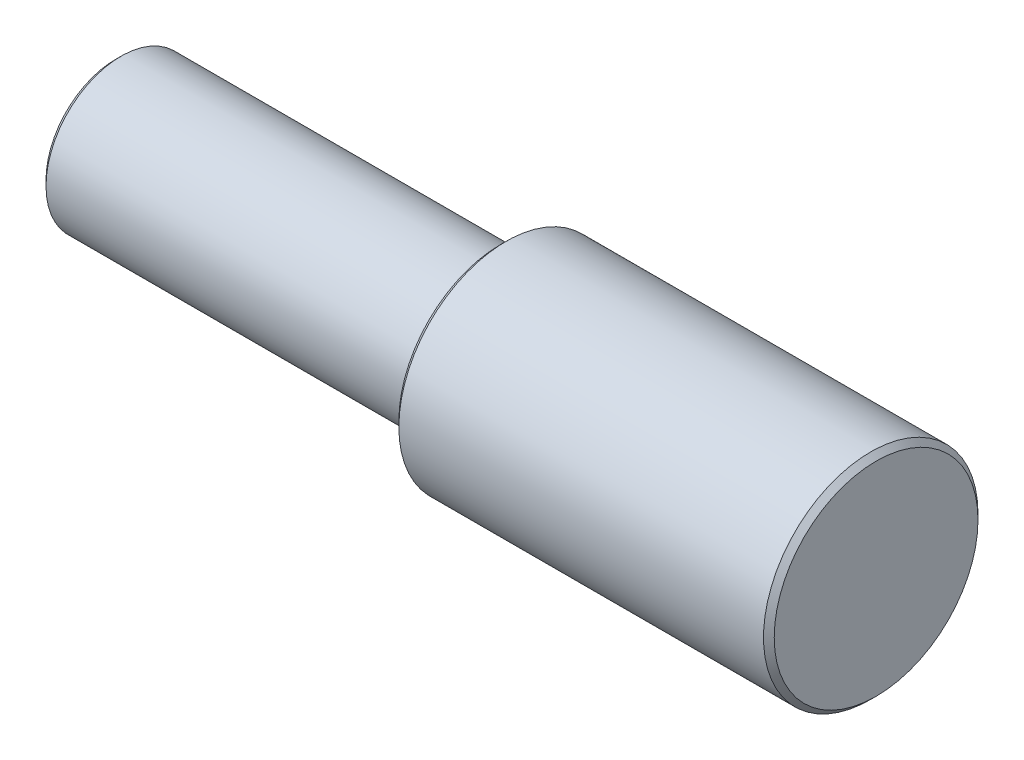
ISO-10303-21;
HEADER;
FILE_DESCRIPTION(('STEP AP214'),'2;1');
FILE_NAME('part.step','',(''),(''),'','','');
FILE_SCHEMA(('AUTOMOTIVE_DESIGN { 1 0 10303 214 1 1 1 1 }'));
ENDSEC;
DATA;
#1=APPLICATION_CONTEXT('core data for automotive mechanical design processes');
#2=APPLICATION_PROTOCOL_DEFINITION('international standard','automotive_design',2000,#1);
#3=PRODUCT_CONTEXT('',#1,'mechanical');
#4=PRODUCT('Part','Part','',(#3));
#5=PRODUCT_RELATED_PRODUCT_CATEGORY('part','',(#4));
#6=PRODUCT_DEFINITION_FORMATION('','',#4);
#7=PRODUCT_DEFINITION_CONTEXT('part definition',#1,'design');
#8=PRODUCT_DEFINITION('design','',#6,#7);
#9=PRODUCT_DEFINITION_SHAPE('','',#8);
#10=(LENGTH_UNIT() NAMED_UNIT(*) SI_UNIT(.MILLI.,.METRE.));
#11=(NAMED_UNIT(*) PLANE_ANGLE_UNIT() SI_UNIT($,.RADIAN.));
#12=(NAMED_UNIT(*) SI_UNIT($,.STERADIAN.) SOLID_ANGLE_UNIT());
#13=UNCERTAINTY_MEASURE_WITH_UNIT(LENGTH_MEASURE(1.E-05),#10,'distance_accuracy_value','');
#14=(GEOMETRIC_REPRESENTATION_CONTEXT(3) GLOBAL_UNCERTAINTY_ASSIGNED_CONTEXT((#13)) GLOBAL_UNIT_ASSIGNED_CONTEXT((#10,
#11,#12)) REPRESENTATION_CONTEXT('',''));
#15=CARTESIAN_POINT('',(0.,0.,0.));
#16=DIRECTION('',(0.,0.,1.));
#17=DIRECTION('',(1.,0.,0.));
#18=AXIS2_PLACEMENT_3D('',#15,#16,#17);
#19=CARTESIAN_POINT('',(-35.,0.,0.));
#20=DIRECTION('',(1.,0.,0.));
#21=DIRECTION('',(0.,0.,-1.));
#22=AXIS2_PLACEMENT_3D('',#19,#20,#21);
#23=CYLINDRICAL_SURFACE('',#22,10.);
#24=CARTESIAN_POINT('',(-0.500000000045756,0.,0.));
#25=DIRECTION('',(1.,0.,0.));
#26=DIRECTION('',(0.,0.,-1.));
#27=AXIS2_PLACEMENT_3D('',#24,#25,#26);
#28=CIRCLE('',#27,10.);
#29=CARTESIAN_POINT('',(-0.500000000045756,0.,-10.));
#30=VERTEX_POINT('',#29);
#31=EDGE_CURVE('E123',#30,#30,#28,.F.);
#32=ORIENTED_EDGE('',*,*,#31,.T.);
#33=EDGE_LOOP('',(#32));
#34=FACE_BOUND('',#33,.T.);
#35=CARTESIAN_POINT('',(-34.4999999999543,0.,0.));
#36=DIRECTION('',(-1.,0.,0.));
#37=DIRECTION('',(0.,0.,1.));
#38=AXIS2_PLACEMENT_3D('',#35,#36,#37);
#39=CIRCLE('',#38,10.);
#40=CARTESIAN_POINT('',(-34.4999999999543,0.,10.));
#41=VERTEX_POINT('',#40);
#42=EDGE_CURVE('E120',#41,#41,#39,.F.);
#43=ORIENTED_EDGE('',*,*,#42,.T.);
#44=EDGE_LOOP('',(#43));
#45=FACE_BOUND('',#44,.T.);
#46=ADVANCED_FACE('F35',(#34,#45),#23,.T.);
#47=CARTESIAN_POINT('',(-35.,10.,0.));
#48=DIRECTION('',(-1.,0.,0.));
#49=DIRECTION('',(0.,0.,1.));
#50=AXIS2_PLACEMENT_3D('',#47,#48,#49);
#51=PLANE('',#50);
#52=CARTESIAN_POINT('',(-35.,0.,0.));
#53=DIRECTION('',(-1.,0.,0.));
#54=DIRECTION('',(0.,0.,1.));
#55=AXIS2_PLACEMENT_3D('',#52,#53,#54);
#56=CIRCLE('',#55,9.49999999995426);
#57=CARTESIAN_POINT('',(-35.,0.,9.49999999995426));
#58=VERTEX_POINT('',#57);
#59=EDGE_CURVE('E126',#58,#58,#56,.T.);
#60=ORIENTED_EDGE('',*,*,#59,.T.);
#61=EDGE_LOOP('',(#60));
#62=FACE_BOUND('',#61,.T.);
#63=CARTESIAN_POINT('',(-35.,0.,0.));
#64=DIRECTION('',(-1.,0.,0.));
#65=DIRECTION('',(0.,0.,1.));
#66=AXIS2_PLACEMENT_3D('',#63,#64,#65);
#67=CIRCLE('',#66,6.99999999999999);
#68=CARTESIAN_POINT('',(-35.,0.,6.99999999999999));
#69=VERTEX_POINT('',#68);
#70=EDGE_CURVE('E114',#69,#69,#67,.T.);
#71=ORIENTED_EDGE('',*,*,#70,.F.);
#72=EDGE_LOOP('',(#71));
#73=FACE_BOUND('',#72,.T.);
#74=ADVANCED_FACE('F182',(#62,#73),#51,.T.);
#75=CARTESIAN_POINT('',(0.,0.,0.));
#76=DIRECTION('',(1.,0.,0.));
#77=DIRECTION('',(0.,0.,-1.));
#78=AXIS2_PLACEMENT_3D('',#75,#76,#77);
#79=PLANE('',#78);
#80=CARTESIAN_POINT('',(0.,0.,0.));
#81=DIRECTION('',(1.,0.,0.));
#82=DIRECTION('',(0.,0.,-1.));
#83=AXIS2_PLACEMENT_3D('',#80,#81,#82);
#84=CIRCLE('',#83,9.49999999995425);
#85=CARTESIAN_POINT('',(0.,0.,-9.49999999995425));
#86=VERTEX_POINT('',#85);
#87=EDGE_CURVE('E117',#86,#86,#84,.T.);
#88=ORIENTED_EDGE('',*,*,#87,.T.);
#89=EDGE_LOOP('',(#88));
#90=FACE_BOUND('',#89,.T.);
#91=ADVANCED_FACE('F178',(#90),#79,.T.);
#92=CARTESIAN_POINT('',(-70.9,0.,0.));
#93=DIRECTION('',(1.,0.,0.));
#94=DIRECTION('',(0.,0.,-1.));
#95=AXIS2_PLACEMENT_3D('',#92,#93,#94);
#96=CYLINDRICAL_SURFACE('',#95,6.99999999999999);
#97=DIRECTION('',(1.,0.,0.));
#98=VECTOR('',#97,1.);
#99=CARTESIAN_POINT('',(-70.9,-2.5,-6.538348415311));
#100=LINE('',#99,#98);
#101=CARTESIAN_POINT('',(-65.45,-2.5,-6.538348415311));
#102=VERTEX_POINT('',#101);
#103=CARTESIAN_POINT('',(-40.45,-2.5,-6.538348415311));
#104=VERTEX_POINT('',#103);
#105=EDGE_CURVE('E49',#102,#104,#100,.T.);
#106=ORIENTED_EDGE('',*,*,#105,.T.);
#107=CARTESIAN_POINT('',(-40.45,-2.5,-6.53834841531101));
#108=CARTESIAN_POINT('',(-40.3821107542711,-2.50000932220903,-6.53833653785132));
#109=CARTESIAN_POINT('',(-40.3142280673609,-2.49723485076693,-6.53940549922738));
#110=CARTESIAN_POINT('',(-40.1789960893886,-2.48619102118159,-6.54361657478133));
#111=CARTESIAN_POINT('',(-40.1116466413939,-2.47792334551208,-6.54675805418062));
#112=CARTESIAN_POINT('',(-39.9781785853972,-2.45600175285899,-6.55501217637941));
#113=CARTESIAN_POINT('',(-39.9120566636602,-2.44236559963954,-6.56011831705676));
#114=CARTESIAN_POINT('',(-39.7812981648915,-2.40985115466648,-6.57213177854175));
#115=CARTESIAN_POINT('',(-39.7166616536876,-2.39097263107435,-6.57903917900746));
#116=CARTESIAN_POINT('',(-39.5257356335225,-2.32673964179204,-6.60214934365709));
#117=CARTESIAN_POINT('',(-39.4022095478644,-2.27375112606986,-6.62075475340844));
#118=CARTESIAN_POINT('',(-39.165769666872,-2.14910757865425,-6.6622539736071));
#119=CARTESIAN_POINT('',(-39.0528636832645,-2.07743895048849,-6.68515090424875));
#120=CARTESIAN_POINT('',(-38.8357847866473,-1.91402571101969,-6.73379913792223));
#121=CARTESIAN_POINT('',(-38.7321535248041,-1.82158337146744,-6.75962864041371));
#122=CARTESIAN_POINT('',(-38.5414912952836,-1.6207338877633,-6.8105759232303));
#123=CARTESIAN_POINT('',(-38.4544634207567,-1.51232377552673,-6.83569357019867));
#124=CARTESIAN_POINT('',(-38.296910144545,-1.27853915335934,-6.88331133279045));
#125=CARTESIAN_POINT('',(-38.2269684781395,-1.15274833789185,-6.90570835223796));
#126=CARTESIAN_POINT('',(-38.1094633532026,-0.890250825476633,-6.94442357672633));
#127=CARTESIAN_POINT('',(-38.061892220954,-0.753547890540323,-6.96074386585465));
#128=CARTESIAN_POINT('',(-37.9923593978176,-0.47882997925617,-6.9849105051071));
#129=CARTESIAN_POINT('',(-37.9694608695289,-0.341079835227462,-6.99306594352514));
#130=CARTESIAN_POINT('',(-37.9469315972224,-0.0634643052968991,-7.00108798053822));
#131=CARTESIAN_POINT('',(-37.9472944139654,0.0764004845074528,-7.00095687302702));
#132=CARTESIAN_POINT('',(-37.9707112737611,0.34759325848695,-6.99262258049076));
#133=CARTESIAN_POINT('',(-37.9927447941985,0.479022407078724,-6.98478243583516));
#134=CARTESIAN_POINT('',(-38.0571734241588,0.736175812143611,-6.96237832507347));
#135=CARTESIAN_POINT('',(-38.0995696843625,0.861899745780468,-6.94781397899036));
#136=CARTESIAN_POINT('',(-38.2040469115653,1.10616102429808,-6.91316506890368));
#137=CARTESIAN_POINT('',(-38.2663957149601,1.22457279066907,-6.89300592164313));
#138=CARTESIAN_POINT('',(-38.4087793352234,1.44953531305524,-6.8492335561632));
#139=CARTESIAN_POINT('',(-38.4888195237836,1.55608245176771,-6.82561928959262));
#140=CARTESIAN_POINT('',(-38.6693232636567,1.7603244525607,-6.77590547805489));
#141=CARTESIAN_POINT('',(-38.7706497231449,1.85724185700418,-6.74974055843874));
#142=CARTESIAN_POINT('',(-38.9883273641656,2.03299914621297,-6.69890342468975));
#143=CARTESIAN_POINT('',(-39.1046839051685,2.11183255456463,-6.67423174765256));
#144=CARTESIAN_POINT('',(-39.351942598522,2.25049860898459,-6.62877803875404));
#145=CARTESIAN_POINT('',(-39.4830789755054,2.30994207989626,-6.60807875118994));
#146=CARTESIAN_POINT('',(-39.7543648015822,2.4055543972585,-6.57388213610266));
#147=CARTESIAN_POINT('',(-39.894499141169,2.44176119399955,-6.56037307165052));
#148=CARTESIAN_POINT('',(-40.1050305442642,2.47705497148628,-6.54708542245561));
#149=CARTESIAN_POINT('',(-40.1737363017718,2.48565347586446,-6.54382010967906));
#150=CARTESIAN_POINT('',(-40.3116151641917,2.49712352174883,-6.53944910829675));
#151=CARTESIAN_POINT('',(-40.3807876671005,2.50000139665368,-6.53834103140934));
#152=CARTESIAN_POINT('',(-40.45,2.50000000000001,-6.538348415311));
#153=B_SPLINE_CURVE_WITH_KNOTS('',3,(#107,#108,#109,#110,#111,#112,#113,#114,#115,#116,#117,
#118,#119,#120,#121,#122,#123,#124,#125,#126,#127,#128,#129,#130,#131,#132,#133,#134,#135,#136,
#137,#138,#139,#140,#141,#142,#143,#144,#145,#146,#147,#148,#149,#150,#151,#152),.UNSPECIFIED.,
.F.,.F.,(4,2,2,2,2,2,2,2,2,2,2,2,2,2,2,2,2,2,2,2,2,2,4),(0.,0.203591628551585,0.407120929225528,
0.609982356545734,0.812852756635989,1.21793118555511,1.6233052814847,2.04515972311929,
2.4670926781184,2.9018839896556,3.33652604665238,3.75400993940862,4.17137826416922,
4.56998920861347,4.96862268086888,5.37284909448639,5.77719841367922,6.20315837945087,
6.62927065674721,7.06347329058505,7.49696496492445,7.70468580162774,7.91217653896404),.UNSPECIFIED.);
#154=CARTESIAN_POINT('',(-40.45,2.50000000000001,-6.538348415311));
#155=VERTEX_POINT('',#154);
#156=EDGE_CURVE('E11',#104,#155,#153,.T.);
#157=ORIENTED_EDGE('',*,*,#156,.T.);
#158=DIRECTION('',(1.,0.,0.));
#159=VECTOR('',#158,1.);
#160=CARTESIAN_POINT('',(-70.9,2.5,-6.538348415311));
#161=LINE('',#160,#159);
#162=CARTESIAN_POINT('',(-65.45,2.5,-6.538348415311));
#163=VERTEX_POINT('',#162);
#164=EDGE_CURVE('E85',#155,#163,#161,.F.);
#165=ORIENTED_EDGE('',*,*,#164,.T.);
#166=CARTESIAN_POINT('',(-65.45,2.5,-6.538348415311));
#167=CARTESIAN_POINT('',(-65.517889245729,2.50000932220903,-6.53833653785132));
#168=CARTESIAN_POINT('',(-65.5857719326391,2.49723485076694,-6.53940549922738));
#169=CARTESIAN_POINT('',(-65.7210039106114,2.4861910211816,-6.54361657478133));
#170=CARTESIAN_POINT('',(-65.7883533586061,2.47792334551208,-6.54675805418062));
#171=CARTESIAN_POINT('',(-65.9218214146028,2.456001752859,-6.55501217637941));
#172=CARTESIAN_POINT('',(-65.9879433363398,2.44236559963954,-6.56011831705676));
#173=CARTESIAN_POINT('',(-66.1187018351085,2.40985115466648,-6.57213177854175));
#174=CARTESIAN_POINT('',(-66.1833383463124,2.39097263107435,-6.57903917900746));
#175=CARTESIAN_POINT('',(-66.3742643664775,2.32673964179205,-6.60214934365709));
#176=CARTESIAN_POINT('',(-66.4977904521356,2.27375112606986,-6.62075475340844));
#177=CARTESIAN_POINT('',(-66.734230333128,2.14910757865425,-6.66225397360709));
#178=CARTESIAN_POINT('',(-66.8471363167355,2.07743895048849,-6.68515090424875));
#179=CARTESIAN_POINT('',(-67.0642152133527,1.9140257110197,-6.73379913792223));
#180=CARTESIAN_POINT('',(-67.1678464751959,1.82158337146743,-6.75962864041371));
#181=CARTESIAN_POINT('',(-67.3585087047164,1.6207338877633,-6.8105759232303));
#182=CARTESIAN_POINT('',(-67.4455365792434,1.51232377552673,-6.83569357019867));
#183=CARTESIAN_POINT('',(-67.603089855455,1.27853915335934,-6.88331133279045));
#184=CARTESIAN_POINT('',(-67.6730315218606,1.15274833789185,-6.90570835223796));
#185=CARTESIAN_POINT('',(-67.7905366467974,0.890250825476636,-6.94442357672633));
#186=CARTESIAN_POINT('',(-67.838107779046,0.753547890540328,-6.96074386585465));
#187=CARTESIAN_POINT('',(-67.9076406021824,0.478829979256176,-6.9849105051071));
#188=CARTESIAN_POINT('',(-67.9305391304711,0.341079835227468,-6.99306594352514));
#189=CARTESIAN_POINT('',(-67.9530684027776,0.0634643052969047,-7.00108798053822));
#190=CARTESIAN_POINT('',(-67.9527055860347,-0.0764004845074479,-7.00095687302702));
#191=CARTESIAN_POINT('',(-67.9292887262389,-0.347593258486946,-6.99262258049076));
#192=CARTESIAN_POINT('',(-67.9072552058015,-0.479022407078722,-6.98478243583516));
#193=CARTESIAN_POINT('',(-67.8428265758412,-0.736175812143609,-6.96237832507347));
#194=CARTESIAN_POINT('',(-67.8004303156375,-0.861899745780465,-6.94781397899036));
#195=CARTESIAN_POINT('',(-67.6959530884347,-1.10616102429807,-6.91316506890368));
#196=CARTESIAN_POINT('',(-67.6336042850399,-1.22457279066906,-6.89300592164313));
#197=CARTESIAN_POINT('',(-67.4912206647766,-1.44953531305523,-6.8492335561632));
#198=CARTESIAN_POINT('',(-67.4111804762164,-1.55608245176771,-6.82561928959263));
#199=CARTESIAN_POINT('',(-67.2306767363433,-1.76032445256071,-6.77590547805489));
#200=CARTESIAN_POINT('',(-67.1293502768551,-1.85724185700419,-6.74974055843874));
#201=CARTESIAN_POINT('',(-66.9116726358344,-2.03299914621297,-6.69890342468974));
#202=CARTESIAN_POINT('',(-66.7953160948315,-2.11183255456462,-6.67423174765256));
#203=CARTESIAN_POINT('',(-66.548057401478,-2.25049860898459,-6.62877803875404));
#204=CARTESIAN_POINT('',(-66.4169210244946,-2.30994207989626,-6.60807875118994));
#205=CARTESIAN_POINT('',(-66.1456351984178,-2.4055543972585,-6.57388213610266));
#206=CARTESIAN_POINT('',(-66.005500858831,-2.44176119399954,-6.56037307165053));
#207=CARTESIAN_POINT('',(-65.7949694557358,-2.47705497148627,-6.54708542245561));
#208=CARTESIAN_POINT('',(-65.7262636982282,-2.48565347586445,-6.54382010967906));
#209=CARTESIAN_POINT('',(-65.5883848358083,-2.49712352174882,-6.53944910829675));
#210=CARTESIAN_POINT('',(-65.5192123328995,-2.50000139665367,-6.53834103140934));
#211=CARTESIAN_POINT('',(-65.45,-2.5,-6.538348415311));
#212=B_SPLINE_CURVE_WITH_KNOTS('',3,(#166,#167,#168,#169,#170,#171,#172,#173,#174,#175,#176,
#177,#178,#179,#180,#181,#182,#183,#184,#185,#186,#187,#188,#189,#190,#191,#192,#193,#194,#195,
#196,#197,#198,#199,#200,#201,#202,#203,#204,#205,#206,#207,#208,#209,#210,#211),.UNSPECIFIED.,
.F.,.F.,(4,2,2,2,2,2,2,2,2,2,2,2,2,2,2,2,2,2,2,2,2,2,4),(0.,0.203591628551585,0.407120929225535,
0.609982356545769,0.812852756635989,1.21793118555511,1.6233052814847,2.04515972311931,
2.4670926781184,2.90188398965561,3.33652604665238,3.75400993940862,4.17137826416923,
4.56998920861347,4.96862268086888,5.3728490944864,5.77719841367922,6.2031583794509,
6.62927065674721,7.06347329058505,7.49696496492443,7.70468580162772,7.91217653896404),.UNSPECIFIED.);
#213=EDGE_CURVE('E142',#163,#102,#212,.T.);
#214=ORIENTED_EDGE('',*,*,#213,.T.);
#215=EDGE_LOOP('',(#106,#157,#165,#214));
#216=FACE_BOUND('',#215,.T.);
#217=CARTESIAN_POINT('',(-70.3999999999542,0.,0.));
#218=DIRECTION('',(-1.,0.,0.));
#219=DIRECTION('',(0.,0.,1.));
#220=AXIS2_PLACEMENT_3D('',#217,#218,#219);
#221=CIRCLE('',#220,6.99999999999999);
#222=CARTESIAN_POINT('',(-70.3999999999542,0.,6.99999999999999));
#223=VERTEX_POINT('',#222);
#224=EDGE_CURVE('E138',#223,#223,#221,.F.);
#225=ORIENTED_EDGE('',*,*,#224,.T.);
#226=EDGE_LOOP('',(#225));
#227=FACE_BOUND('',#226,.T.);
#228=ORIENTED_EDGE('',*,*,#70,.T.);
#229=EDGE_LOOP('',(#228));
#230=FACE_BOUND('',#229,.T.);
#231=ADVANCED_FACE('F149',(#216,#227,#230),#96,.T.);
#232=CARTESIAN_POINT('',(-70.9,0.,0.));
#233=DIRECTION('',(-1.,0.,0.));
#234=DIRECTION('',(0.,0.,1.));
#235=AXIS2_PLACEMENT_3D('',#232,#233,#234);
#236=PLANE('',#235);
#237=CARTESIAN_POINT('',(-70.9,0.,0.));
#238=DIRECTION('',(-1.,0.,0.));
#239=DIRECTION('',(0.,0.,1.));
#240=AXIS2_PLACEMENT_3D('',#237,#238,#239);
#241=CIRCLE('',#240,3.00000000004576);
#242=CARTESIAN_POINT('',(-70.9,0.,3.00000000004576));
#243=VERTEX_POINT('',#242);
#244=EDGE_CURVE('E135',#243,#243,#241,.F.);
#245=ORIENTED_EDGE('',*,*,#244,.T.);
#246=EDGE_LOOP('',(#245));
#247=FACE_BOUND('',#246,.T.);
#248=CARTESIAN_POINT('',(-70.9,0.,0.));
#249=DIRECTION('',(-1.,0.,0.));
#250=DIRECTION('',(0.,0.,1.));
#251=AXIS2_PLACEMENT_3D('',#248,#249,#250);
#252=CIRCLE('',#251,6.49999999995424);
#253=CARTESIAN_POINT('',(-70.9,0.,6.49999999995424));
#254=VERTEX_POINT('',#253);
#255=EDGE_CURVE('E132',#254,#254,#252,.T.);
#256=ORIENTED_EDGE('',*,*,#255,.T.);
#257=EDGE_LOOP('',(#256));
#258=FACE_BOUND('',#257,.T.);
#259=ADVANCED_FACE('F172',(#247,#258),#236,.T.);
#260=CARTESIAN_POINT('',(-45.9,0.,0.));
#261=DIRECTION('',(-1.,0.,0.));
#262=DIRECTION('',(0.,0.,1.));
#263=AXIS2_PLACEMENT_3D('',#260,#261,#262);
#264=CONICAL_SURFACE('',#263,2.5,1.02974425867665);
#265=CARTESIAN_POINT('',(-44.3978484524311,0.,0.));
#266=VERTEX_POINT('',#265);
#267=VERTEX_LOOP('',#266);
#268=FACE_BOUND('',#267,.T.);
#269=CARTESIAN_POINT('',(-45.9,0.,0.));
#270=DIRECTION('',(-1.,0.,0.));
#271=DIRECTION('',(0.,0.,1.));
#272=AXIS2_PLACEMENT_3D('',#269,#270,#271);
#273=CIRCLE('',#272,2.5);
#274=CARTESIAN_POINT('',(-45.9,0.,2.5));
#275=VERTEX_POINT('',#274);
#276=EDGE_CURVE('E108',#275,#275,#273,.T.);
#277=ORIENTED_EDGE('',*,*,#276,.T.);
#278=EDGE_LOOP('',(#277));
#279=FACE_BOUND('',#278,.T.);
#280=ADVANCED_FACE('F169',(#268,#279),#264,.F.);
#281=CARTESIAN_POINT('',(-70.9,0.,0.));
#282=DIRECTION('',(-1.,0.,0.));
#283=DIRECTION('',(0.,0.,1.));
#284=AXIS2_PLACEMENT_3D('',#281,#282,#283);
#285=CYLINDRICAL_SURFACE('',#284,2.5);
#286=CARTESIAN_POINT('',(-70.3999999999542,0.,0.));
#287=DIRECTION('',(-1.,0.,0.));
#288=DIRECTION('',(0.,0.,1.));
#289=AXIS2_PLACEMENT_3D('',#286,#287,#288);
#290=CIRCLE('',#289,2.5);
#291=CARTESIAN_POINT('',(-70.3999999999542,0.,2.5));
#292=VERTEX_POINT('',#291);
#293=EDGE_CURVE('E129',#292,#292,#290,.T.);
#294=ORIENTED_EDGE('',*,*,#293,.T.);
#295=EDGE_LOOP('',(#294));
#296=FACE_BOUND('',#295,.T.);
#297=ORIENTED_EDGE('',*,*,#276,.F.);
#298=EDGE_LOOP('',(#297));
#299=FACE_BOUND('',#298,.T.);
#300=ADVANCED_FACE('F165',(#296,#299),#285,.F.);
#301=CARTESIAN_POINT('',(0.,0.,0.));
#302=DIRECTION('',(-1.,0.,0.));
#303=DIRECTION('',(0.,0.,1.));
#304=AXIS2_PLACEMENT_3D('',#301,#302,#303);
#305=CONICAL_SURFACE('',#304,9.49999999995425,0.785398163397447);
#306=ORIENTED_EDGE('',*,*,#31,.F.);
#307=EDGE_LOOP('',(#306));
#308=FACE_BOUND('',#307,.T.);
#309=ORIENTED_EDGE('',*,*,#87,.F.);
#310=EDGE_LOOP('',(#309));
#311=FACE_BOUND('',#310,.T.);
#312=ADVANCED_FACE('F168',(#308,#311),#305,.T.);
#313=CARTESIAN_POINT('',(-34.4999999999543,0.,0.));
#314=DIRECTION('',(1.,0.,0.));
#315=DIRECTION('',(0.,0.,-1.));
#316=AXIS2_PLACEMENT_3D('',#313,#314,#315);
#317=CONICAL_SURFACE('',#316,10.,0.785398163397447);
#318=ORIENTED_EDGE('',*,*,#59,.F.);
#319=EDGE_LOOP('',(#318));
#320=FACE_BOUND('',#319,.T.);
#321=ORIENTED_EDGE('',*,*,#42,.F.);
#322=EDGE_LOOP('',(#321));
#323=FACE_BOUND('',#322,.T.);
#324=ADVANCED_FACE('F194',(#320,#323),#317,.T.);
#325=CARTESIAN_POINT('',(-70.3999999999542,0.,0.));
#326=DIRECTION('',(-1.,0.,0.));
#327=DIRECTION('',(0.,0.,1.));
#328=AXIS2_PLACEMENT_3D('',#325,#326,#327);
#329=CONICAL_SURFACE('',#328,2.5,0.785398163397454);
#330=ORIENTED_EDGE('',*,*,#244,.F.);
#331=EDGE_LOOP('',(#330));
#332=FACE_BOUND('',#331,.T.);
#333=ORIENTED_EDGE('',*,*,#293,.F.);
#334=EDGE_LOOP('',(#333));
#335=FACE_BOUND('',#334,.T.);
#336=ADVANCED_FACE('F197',(#332,#335),#329,.F.);
#337=CARTESIAN_POINT('',(-70.9,0.,0.));
#338=DIRECTION('',(1.,0.,0.));
#339=DIRECTION('',(0.,0.,-1.));
#340=AXIS2_PLACEMENT_3D('',#337,#338,#339);
#341=CONICAL_SURFACE('',#340,6.49999999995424,0.785398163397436);
#342=ORIENTED_EDGE('',*,*,#224,.F.);
#343=EDGE_LOOP('',(#342));
#344=FACE_BOUND('',#343,.T.);
#345=ORIENTED_EDGE('',*,*,#255,.F.);
#346=EDGE_LOOP('',(#345));
#347=FACE_BOUND('',#346,.T.);
#348=ADVANCED_FACE('F37',(#344,#347),#341,.T.);
#349=CARTESIAN_POINT('',(-40.45,0.,-14.));
#350=DIRECTION('',(0.,0.,1.));
#351=DIRECTION('',(1.,0.,0.));
#352=AXIS2_PLACEMENT_3D('',#349,#350,#351);
#353=CYLINDRICAL_SURFACE('',#352,2.5);
#354=DIRECTION('',(0.,0.,1.));
#355=VECTOR('',#354,1.);
#356=CARTESIAN_POINT('',(-40.45,-2.5,-14.));
#357=LINE('',#356,#355);
#358=CARTESIAN_POINT('',(-40.45,-2.5,-4.));
#359=VERTEX_POINT('',#358);
#360=EDGE_CURVE('E102',#104,#359,#357,.T.);
#361=ORIENTED_EDGE('',*,*,#360,.T.);
#362=CARTESIAN_POINT('',(-40.45,0.,-4.));
#363=DIRECTION('',(0.,0.,1.));
#364=DIRECTION('',(1.,0.,0.));
#365=AXIS2_PLACEMENT_3D('',#362,#363,#364);
#366=CIRCLE('',#365,2.5);
#367=CARTESIAN_POINT('',(-40.45,2.50000000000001,-4.));
#368=VERTEX_POINT('',#367);
#369=EDGE_CURVE('E95',#359,#368,#366,.T.);
#370=ORIENTED_EDGE('',*,*,#369,.T.);
#371=DIRECTION('',(0.,0.,1.));
#372=VECTOR('',#371,1.);
#373=CARTESIAN_POINT('',(-40.45,2.50000000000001,-14.));
#374=LINE('',#373,#372);
#375=EDGE_CURVE('E80',#155,#368,#374,.T.);
#376=ORIENTED_EDGE('',*,*,#375,.F.);
#377=ORIENTED_EDGE('',*,*,#156,.F.);
#378=EDGE_LOOP('',(#361,#370,#376,#377));
#379=FACE_BOUND('',#378,.T.);
#380=ADVANCED_FACE('F100',(#379),#353,.F.);
#381=CARTESIAN_POINT('',(-65.45,-2.5,-14.));
#382=DIRECTION('',(0.,-1.,0.));
#383=DIRECTION('',(1.,0.,0.));
#384=AXIS2_PLACEMENT_3D('',#381,#382,#383);
#385=PLANE('',#384);
#386=DIRECTION('',(0.,0.,1.));
#387=VECTOR('',#386,1.);
#388=CARTESIAN_POINT('',(-65.45,-2.5,-14.));
#389=LINE('',#388,#387);
#390=CARTESIAN_POINT('',(-65.45,-2.5,-4.));
#391=VERTEX_POINT('',#390);
#392=EDGE_CURVE('E109',#102,#391,#389,.T.);
#393=ORIENTED_EDGE('',*,*,#392,.T.);
#394=DIRECTION('',(1.,0.,0.));
#395=VECTOR('',#394,1.);
#396=CARTESIAN_POINT('',(-65.45,-2.5,-4.));
#397=LINE('',#396,#395);
#398=EDGE_CURVE('E88',#391,#359,#397,.T.);
#399=ORIENTED_EDGE('',*,*,#398,.T.);
#400=ORIENTED_EDGE('',*,*,#360,.F.);
#401=ORIENTED_EDGE('',*,*,#105,.F.);
#402=EDGE_LOOP('',(#393,#399,#400,#401));
#403=FACE_BOUND('',#402,.T.);
#404=ADVANCED_FACE('F158',(#403),#385,.F.);
#405=CARTESIAN_POINT('',(-65.45,0.,-14.));
#406=DIRECTION('',(0.,0.,1.));
#407=DIRECTION('',(1.,0.,0.));
#408=AXIS2_PLACEMENT_3D('',#405,#406,#407);
#409=CYLINDRICAL_SURFACE('',#408,2.5);
#410=DIRECTION('',(0.,0.,1.));
#411=VECTOR('',#410,1.);
#412=CARTESIAN_POINT('',(-65.45,2.5,-14.));
#413=LINE('',#412,#411);
#414=CARTESIAN_POINT('',(-65.45,2.5,-4.));
#415=VERTEX_POINT('',#414);
#416=EDGE_CURVE('E56',#163,#415,#413,.T.);
#417=ORIENTED_EDGE('',*,*,#416,.T.);
#418=CARTESIAN_POINT('',(-65.45,0.,-4.));
#419=DIRECTION('',(0.,0.,1.));
#420=DIRECTION('',(1.,0.,0.));
#421=AXIS2_PLACEMENT_3D('',#418,#419,#420);
#422=CIRCLE('',#421,2.5);
#423=EDGE_CURVE('E98',#415,#391,#422,.T.);
#424=ORIENTED_EDGE('',*,*,#423,.T.);
#425=ORIENTED_EDGE('',*,*,#392,.F.);
#426=ORIENTED_EDGE('',*,*,#213,.F.);
#427=EDGE_LOOP('',(#417,#424,#425,#426));
#428=FACE_BOUND('',#427,.T.);
#429=ADVANCED_FACE('F153',(#428),#409,.F.);
#430=CARTESIAN_POINT('',(-40.45,2.50000000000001,-14.));
#431=DIRECTION('',(0.,1.,0.));
#432=DIRECTION('',(-1.,0.,0.));
#433=AXIS2_PLACEMENT_3D('',#430,#431,#432);
#434=PLANE('',#433);
#435=ORIENTED_EDGE('',*,*,#375,.T.);
#436=DIRECTION('',(-1.,0.,0.));
#437=VECTOR('',#436,1.);
#438=CARTESIAN_POINT('',(-40.45,2.50000000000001,-4.));
#439=LINE('',#438,#437);
#440=EDGE_CURVE('E83',#368,#415,#439,.T.);
#441=ORIENTED_EDGE('',*,*,#440,.T.);
#442=ORIENTED_EDGE('',*,*,#416,.F.);
#443=ORIENTED_EDGE('',*,*,#164,.F.);
#444=EDGE_LOOP('',(#435,#441,#442,#443));
#445=FACE_BOUND('',#444,.T.);
#446=ADVANCED_FACE('F82',(#445),#434,.F.);
#447=CARTESIAN_POINT('',(-40.45,0.,-4.));
#448=DIRECTION('',(0.,0.,1.));
#449=DIRECTION('',(1.,0.,0.));
#450=AXIS2_PLACEMENT_3D('',#447,#448,#449);
#451=PLANE('',#450);
#452=ORIENTED_EDGE('',*,*,#369,.F.);
#453=ORIENTED_EDGE('',*,*,#398,.F.);
#454=ORIENTED_EDGE('',*,*,#423,.F.);
#455=ORIENTED_EDGE('',*,*,#440,.F.);
#456=EDGE_LOOP('',(#452,#453,#454,#455));
#457=FACE_BOUND('',#456,.T.);
#458=ADVANCED_FACE('F93',(#457),#451,.F.);
#459=CLOSED_SHELL('',(#46,#74,#91,#231,#259,#280,#300,#312,#324,#336,#348,#380,#404,#429,#446,#458));
#460=MANIFOLD_SOLID_BREP('B2',#459);
#461=ADVANCED_BREP_SHAPE_REPRESENTATION('',(#18,#460),#14);
#462=SHAPE_DEFINITION_REPRESENTATION(#9,#461);
ENDSEC;
END-ISO-10303-21;
